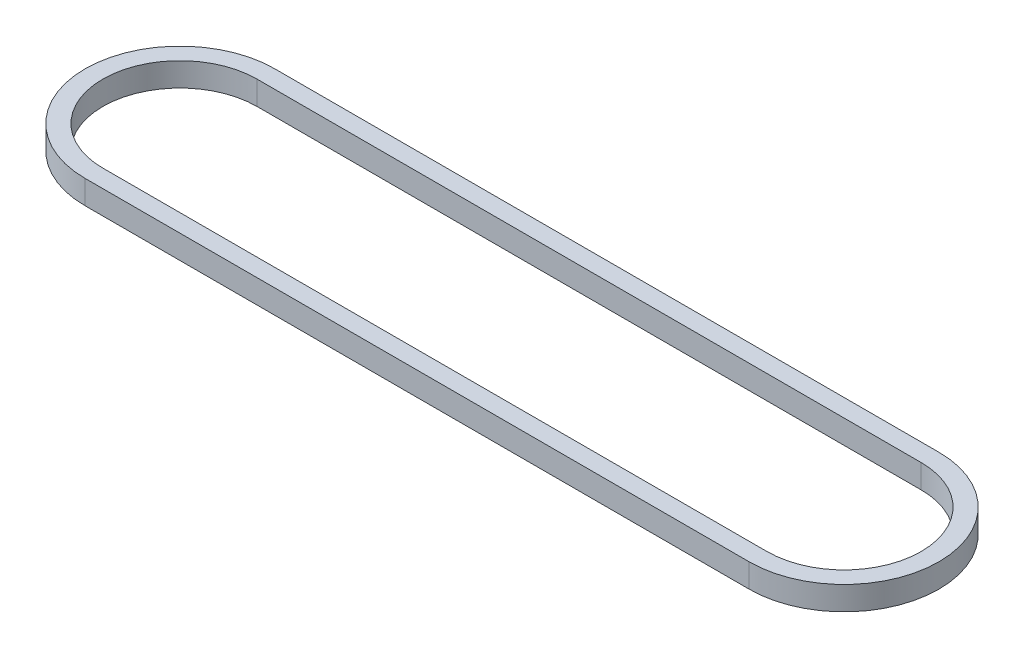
ISO-10303-21;
HEADER;
FILE_DESCRIPTION(('STEP AP214'),'2;1');
FILE_NAME('part.step','',(''),(''),'','','');
FILE_SCHEMA(('AUTOMOTIVE_DESIGN { 1 0 10303 214 1 1 1 1 }'));
ENDSEC;
DATA;
#1=APPLICATION_CONTEXT('core data for automotive mechanical design processes');
#2=APPLICATION_PROTOCOL_DEFINITION('international standard','automotive_design',2000,#1);
#3=PRODUCT_CONTEXT('',#1,'mechanical');
#4=PRODUCT('Part','Part','',(#3));
#5=PRODUCT_RELATED_PRODUCT_CATEGORY('part','',(#4));
#6=PRODUCT_DEFINITION_FORMATION('','',#4);
#7=PRODUCT_DEFINITION_CONTEXT('part definition',#1,'design');
#8=PRODUCT_DEFINITION('design','',#6,#7);
#9=PRODUCT_DEFINITION_SHAPE('','',#8);
#10=(LENGTH_UNIT() NAMED_UNIT(*) SI_UNIT(.MILLI.,.METRE.));
#11=(NAMED_UNIT(*) PLANE_ANGLE_UNIT() SI_UNIT($,.RADIAN.));
#12=(NAMED_UNIT(*) SI_UNIT($,.STERADIAN.) SOLID_ANGLE_UNIT());
#13=UNCERTAINTY_MEASURE_WITH_UNIT(LENGTH_MEASURE(1.E-05),#10,'distance_accuracy_value','');
#14=(GEOMETRIC_REPRESENTATION_CONTEXT(3) GLOBAL_UNCERTAINTY_ASSIGNED_CONTEXT((#13)) GLOBAL_UNIT_ASSIGNED_CONTEXT((#10,
#11,#12)) REPRESENTATION_CONTEXT('',''));
#15=CARTESIAN_POINT('',(0.,0.,0.));
#16=DIRECTION('',(0.,0.,1.));
#17=DIRECTION('',(1.,0.,0.));
#18=AXIS2_PLACEMENT_3D('',#15,#16,#17);
#19=CARTESIAN_POINT('',(280.,10.,0.));
#20=DIRECTION('',(0.,-1.,0.));
#21=DIRECTION('',(0.,0.,-1.));
#22=AXIS2_PLACEMENT_3D('',#19,#20,#21);
#23=CYLINDRICAL_SURFACE('',#22,32.5);
#24=CARTESIAN_POINT('',(280.,0.,0.));
#25=DIRECTION('',(0.,1.,0.));
#26=DIRECTION('',(0.,0.,1.));
#27=AXIS2_PLACEMENT_3D('',#24,#25,#26);
#28=CIRCLE('',#27,32.5);
#29=CARTESIAN_POINT('',(280.,0.,32.5));
#30=VERTEX_POINT('',#29);
#31=CARTESIAN_POINT('',(280.,0.,-32.5));
#32=VERTEX_POINT('',#31);
#33=EDGE_CURVE('E142',#30,#32,#28,.T.);
#34=ORIENTED_EDGE('',*,*,#33,.F.);
#35=DIRECTION('',(0.,-1.,0.));
#36=VECTOR('',#35,1.);
#37=CARTESIAN_POINT('',(280.,10.,32.5));
#38=LINE('',#37,#36);
#39=CARTESIAN_POINT('',(280.,10.,32.5));
#40=VERTEX_POINT('',#39);
#41=EDGE_CURVE('E11',#40,#30,#38,.T.);
#42=ORIENTED_EDGE('',*,*,#41,.F.);
#43=CARTESIAN_POINT('',(280.,10.,0.));
#44=DIRECTION('',(0.,1.,0.));
#45=DIRECTION('',(0.,0.,1.));
#46=AXIS2_PLACEMENT_3D('',#43,#44,#45);
#47=CIRCLE('',#46,32.5);
#48=CARTESIAN_POINT('',(280.,10.,-32.5));
#49=VERTEX_POINT('',#48);
#50=EDGE_CURVE('E114',#40,#49,#47,.T.);
#51=ORIENTED_EDGE('',*,*,#50,.T.);
#52=DIRECTION('',(0.,-1.,0.));
#53=VECTOR('',#52,1.);
#54=CARTESIAN_POINT('',(280.,10.,-32.5));
#55=LINE('',#54,#53);
#56=EDGE_CURVE('E87',#49,#32,#55,.T.);
#57=ORIENTED_EDGE('',*,*,#56,.T.);
#58=EDGE_LOOP('',(#34,#42,#51,#57));
#59=FACE_BOUND('',#58,.T.);
#60=ADVANCED_FACE('F34',(#59),#23,.F.);
#61=CARTESIAN_POINT('',(-146.986327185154,10.,32.5));
#62=DIRECTION('',(0.,0.,1.));
#63=DIRECTION('',(1.,0.,0.));
#64=AXIS2_PLACEMENT_3D('',#61,#62,#63);
#65=PLANE('',#64);
#66=DIRECTION('',(-1.,0.,0.));
#67=VECTOR('',#66,1.);
#68=CARTESIAN_POINT('',(-146.986327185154,0.,32.5));
#69=LINE('',#68,#67);
#70=CARTESIAN_POINT('',(0.,0.,32.5));
#71=VERTEX_POINT('',#70);
#72=EDGE_CURVE('E120',#30,#71,#69,.T.);
#73=ORIENTED_EDGE('',*,*,#72,.T.);
#74=DIRECTION('',(0.,-1.,0.));
#75=VECTOR('',#74,1.);
#76=CARTESIAN_POINT('',(0.,10.,32.5));
#77=LINE('',#76,#75);
#78=CARTESIAN_POINT('',(0.,10.,32.5));
#79=VERTEX_POINT('',#78);
#80=EDGE_CURVE('E44',#79,#71,#77,.T.);
#81=ORIENTED_EDGE('',*,*,#80,.F.);
#82=DIRECTION('',(-1.,0.,0.));
#83=VECTOR('',#82,1.);
#84=CARTESIAN_POINT('',(-146.986327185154,10.,32.5));
#85=LINE('',#84,#83);
#86=EDGE_CURVE('E109',#40,#79,#85,.T.);
#87=ORIENTED_EDGE('',*,*,#86,.F.);
#88=ORIENTED_EDGE('',*,*,#41,.T.);
#89=EDGE_LOOP('',(#73,#81,#87,#88));
#90=FACE_BOUND('',#89,.T.);
#91=ADVANCED_FACE('F118',(#90),#65,.F.);
#92=CARTESIAN_POINT('',(0.,10.,0.));
#93=DIRECTION('',(0.,-1.,0.));
#94=DIRECTION('',(0.,0.,-1.));
#95=AXIS2_PLACEMENT_3D('',#92,#93,#94);
#96=CYLINDRICAL_SURFACE('',#95,32.5);
#97=CARTESIAN_POINT('',(0.,0.,0.));
#98=DIRECTION('',(0.,1.,0.));
#99=DIRECTION('',(0.,0.,1.));
#100=AXIS2_PLACEMENT_3D('',#97,#98,#99);
#101=CIRCLE('',#100,32.5);
#102=CARTESIAN_POINT('',(0.,0.,-32.5));
#103=VERTEX_POINT('',#102);
#104=EDGE_CURVE('E146',#103,#71,#101,.T.);
#105=ORIENTED_EDGE('',*,*,#104,.F.);
#106=DIRECTION('',(0.,-1.,0.));
#107=VECTOR('',#106,1.);
#108=CARTESIAN_POINT('',(0.,10.,-32.5));
#109=LINE('',#108,#107);
#110=CARTESIAN_POINT('',(0.,10.,-32.5));
#111=VERTEX_POINT('',#110);
#112=EDGE_CURVE('E80',#111,#103,#109,.T.);
#113=ORIENTED_EDGE('',*,*,#112,.F.);
#114=CARTESIAN_POINT('',(0.,10.,0.));
#115=DIRECTION('',(0.,1.,0.));
#116=DIRECTION('',(0.,0.,1.));
#117=AXIS2_PLACEMENT_3D('',#114,#115,#116);
#118=CIRCLE('',#117,32.5);
#119=EDGE_CURVE('E113',#111,#79,#118,.T.);
#120=ORIENTED_EDGE('',*,*,#119,.T.);
#121=ORIENTED_EDGE('',*,*,#80,.T.);
#122=EDGE_LOOP('',(#105,#113,#120,#121));
#123=FACE_BOUND('',#122,.T.);
#124=ADVANCED_FACE('F125',(#123),#96,.F.);
#125=CARTESIAN_POINT('',(-146.986327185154,10.,40.));
#126=DIRECTION('',(0.,0.,-1.));
#127=DIRECTION('',(-1.,0.,0.));
#128=AXIS2_PLACEMENT_3D('',#125,#126,#127);
#129=PLANE('',#128);
#130=DIRECTION('',(1.,0.,0.));
#131=VECTOR('',#130,1.);
#132=CARTESIAN_POINT('',(-146.986327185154,0.,40.));
#133=LINE('',#132,#131);
#134=CARTESIAN_POINT('',(0.,0.,40.));
#135=VERTEX_POINT('',#134);
#136=CARTESIAN_POINT('',(280.,0.,40.));
#137=VERTEX_POINT('',#136);
#138=EDGE_CURVE('E131',#135,#137,#133,.T.);
#139=ORIENTED_EDGE('',*,*,#138,.T.);
#140=DIRECTION('',(0.,-1.,0.));
#141=VECTOR('',#140,1.);
#142=CARTESIAN_POINT('',(280.,10.,40.));
#143=LINE('',#142,#141);
#144=CARTESIAN_POINT('',(280.,10.,40.));
#145=VERTEX_POINT('',#144);
#146=EDGE_CURVE('E38',#145,#137,#143,.T.);
#147=ORIENTED_EDGE('',*,*,#146,.F.);
#148=DIRECTION('',(1.,0.,0.));
#149=VECTOR('',#148,1.);
#150=CARTESIAN_POINT('',(-146.986327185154,10.,40.));
#151=LINE('',#150,#149);
#152=CARTESIAN_POINT('',(0.,10.,40.));
#153=VERTEX_POINT('',#152);
#154=EDGE_CURVE('E150',#153,#145,#151,.T.);
#155=ORIENTED_EDGE('',*,*,#154,.F.);
#156=DIRECTION('',(0.,-1.,0.));
#157=VECTOR('',#156,1.);
#158=CARTESIAN_POINT('',(0.,10.,40.));
#159=LINE('',#158,#157);
#160=EDGE_CURVE('E127',#153,#135,#159,.T.);
#161=ORIENTED_EDGE('',*,*,#160,.T.);
#162=EDGE_LOOP('',(#139,#147,#155,#161));
#163=FACE_BOUND('',#162,.T.);
#164=ADVANCED_FACE('F36',(#163),#129,.F.);
#165=CARTESIAN_POINT('',(280.,10.,0.));
#166=DIRECTION('',(0.,-1.,0.));
#167=DIRECTION('',(0.,0.,-1.));
#168=AXIS2_PLACEMENT_3D('',#165,#166,#167);
#169=CYLINDRICAL_SURFACE('',#168,40.);
#170=CARTESIAN_POINT('',(280.,0.,0.));
#171=DIRECTION('',(0.,1.,0.));
#172=DIRECTION('',(0.,0.,1.));
#173=AXIS2_PLACEMENT_3D('',#170,#171,#172);
#174=CIRCLE('',#173,40.);
#175=CARTESIAN_POINT('',(280.,0.,-40.));
#176=VERTEX_POINT('',#175);
#177=EDGE_CURVE('E134',#137,#176,#174,.T.);
#178=ORIENTED_EDGE('',*,*,#177,.T.);
#179=DIRECTION('',(0.,-1.,0.));
#180=VECTOR('',#179,1.);
#181=CARTESIAN_POINT('',(280.,10.,-40.));
#182=LINE('',#181,#180);
#183=CARTESIAN_POINT('',(280.,10.,-40.));
#184=VERTEX_POINT('',#183);
#185=EDGE_CURVE('E156',#184,#176,#182,.T.);
#186=ORIENTED_EDGE('',*,*,#185,.F.);
#187=CARTESIAN_POINT('',(280.,10.,0.));
#188=DIRECTION('',(0.,1.,0.));
#189=DIRECTION('',(0.,0.,1.));
#190=AXIS2_PLACEMENT_3D('',#187,#188,#189);
#191=CIRCLE('',#190,40.);
#192=EDGE_CURVE('E95',#145,#184,#191,.T.);
#193=ORIENTED_EDGE('',*,*,#192,.F.);
#194=ORIENTED_EDGE('',*,*,#146,.T.);
#195=EDGE_LOOP('',(#178,#186,#193,#194));
#196=FACE_BOUND('',#195,.T.);
#197=ADVANCED_FACE('F161',(#196),#169,.T.);
#198=CARTESIAN_POINT('',(-146.986327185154,10.,-40.));
#199=DIRECTION('',(0.,0.,-1.));
#200=DIRECTION('',(-1.,0.,0.));
#201=AXIS2_PLACEMENT_3D('',#198,#199,#200);
#202=PLANE('',#201);
#203=DIRECTION('',(1.,0.,0.));
#204=VECTOR('',#203,1.);
#205=CARTESIAN_POINT('',(-146.986327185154,0.,-40.));
#206=LINE('',#205,#204);
#207=CARTESIAN_POINT('',(0.,0.,-40.));
#208=VERTEX_POINT('',#207);
#209=EDGE_CURVE('E137',#208,#176,#206,.T.);
#210=ORIENTED_EDGE('',*,*,#209,.F.);
#211=DIRECTION('',(0.,-1.,0.));
#212=VECTOR('',#211,1.);
#213=CARTESIAN_POINT('',(0.,10.,-40.));
#214=LINE('',#213,#212);
#215=CARTESIAN_POINT('',(0.,10.,-40.));
#216=VERTEX_POINT('',#215);
#217=EDGE_CURVE('E155',#216,#208,#214,.T.);
#218=ORIENTED_EDGE('',*,*,#217,.F.);
#219=DIRECTION('',(1.,0.,0.));
#220=VECTOR('',#219,1.);
#221=CARTESIAN_POINT('',(-146.986327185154,10.,-40.));
#222=LINE('',#221,#220);
#223=EDGE_CURVE('E173',#216,#184,#222,.T.);
#224=ORIENTED_EDGE('',*,*,#223,.T.);
#225=ORIENTED_EDGE('',*,*,#185,.T.);
#226=EDGE_LOOP('',(#210,#218,#224,#225));
#227=FACE_BOUND('',#226,.T.);
#228=ADVANCED_FACE('F170',(#227),#202,.T.);
#229=CARTESIAN_POINT('',(0.,10.,0.));
#230=DIRECTION('',(0.,-1.,0.));
#231=DIRECTION('',(0.,0.,-1.));
#232=AXIS2_PLACEMENT_3D('',#229,#230,#231);
#233=CYLINDRICAL_SURFACE('',#232,40.);
#234=CARTESIAN_POINT('',(0.,0.,0.));
#235=DIRECTION('',(0.,1.,0.));
#236=DIRECTION('',(0.,0.,1.));
#237=AXIS2_PLACEMENT_3D('',#234,#235,#236);
#238=CIRCLE('',#237,40.);
#239=EDGE_CURVE('E140',#208,#135,#238,.T.);
#240=ORIENTED_EDGE('',*,*,#239,.T.);
#241=ORIENTED_EDGE('',*,*,#160,.F.);
#242=CARTESIAN_POINT('',(0.,10.,0.));
#243=DIRECTION('',(0.,1.,0.));
#244=DIRECTION('',(0.,0.,1.));
#245=AXIS2_PLACEMENT_3D('',#242,#243,#244);
#246=CIRCLE('',#245,40.);
#247=EDGE_CURVE('E175',#216,#153,#246,.T.);
#248=ORIENTED_EDGE('',*,*,#247,.F.);
#249=ORIENTED_EDGE('',*,*,#217,.T.);
#250=EDGE_LOOP('',(#240,#241,#248,#249));
#251=FACE_BOUND('',#250,.T.);
#252=ADVANCED_FACE('F176',(#251),#233,.T.);
#253=CARTESIAN_POINT('',(-146.986327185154,10.,-32.5));
#254=DIRECTION('',(0.,0.,-1.));
#255=DIRECTION('',(-1.,0.,0.));
#256=AXIS2_PLACEMENT_3D('',#253,#254,#255);
#257=PLANE('',#256);
#258=DIRECTION('',(1.,0.,0.));
#259=VECTOR('',#258,1.);
#260=CARTESIAN_POINT('',(-146.986327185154,0.,-32.5));
#261=LINE('',#260,#259);
#262=EDGE_CURVE('E148',#103,#32,#261,.T.);
#263=ORIENTED_EDGE('',*,*,#262,.T.);
#264=ORIENTED_EDGE('',*,*,#56,.F.);
#265=DIRECTION('',(1.,0.,0.));
#266=VECTOR('',#265,1.);
#267=CARTESIAN_POINT('',(-146.986327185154,10.,-32.5));
#268=LINE('',#267,#266);
#269=EDGE_CURVE('E53',#111,#49,#268,.T.);
#270=ORIENTED_EDGE('',*,*,#269,.F.);
#271=ORIENTED_EDGE('',*,*,#112,.T.);
#272=EDGE_LOOP('',(#263,#264,#270,#271));
#273=FACE_BOUND('',#272,.T.);
#274=ADVANCED_FACE('F182',(#273),#257,.F.);
#275=CARTESIAN_POINT('',(-146.986327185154,10.,0.));
#276=DIRECTION('',(0.,1.,0.));
#277=DIRECTION('',(0.,0.,1.));
#278=AXIS2_PLACEMENT_3D('',#275,#276,#277);
#279=PLANE('',#278);
#280=ORIENTED_EDGE('',*,*,#154,.T.);
#281=ORIENTED_EDGE('',*,*,#192,.T.);
#282=ORIENTED_EDGE('',*,*,#223,.F.);
#283=ORIENTED_EDGE('',*,*,#247,.T.);
#284=EDGE_LOOP('',(#280,#281,#282,#283));
#285=FACE_BOUND('',#284,.T.);
#286=ORIENTED_EDGE('',*,*,#50,.F.);
#287=ORIENTED_EDGE('',*,*,#86,.T.);
#288=ORIENTED_EDGE('',*,*,#119,.F.);
#289=ORIENTED_EDGE('',*,*,#269,.T.);
#290=EDGE_LOOP('',(#286,#287,#288,#289));
#291=FACE_BOUND('',#290,.T.);
#292=ADVANCED_FACE('F111',(#285,#291),#279,.T.);
#293=CARTESIAN_POINT('',(-146.986327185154,0.,0.));
#294=DIRECTION('',(0.,1.,0.));
#295=DIRECTION('',(0.,0.,1.));
#296=AXIS2_PLACEMENT_3D('',#293,#294,#295);
#297=PLANE('',#296);
#298=ORIENTED_EDGE('',*,*,#138,.F.);
#299=ORIENTED_EDGE('',*,*,#239,.F.);
#300=ORIENTED_EDGE('',*,*,#209,.T.);
#301=ORIENTED_EDGE('',*,*,#177,.F.);
#302=EDGE_LOOP('',(#298,#299,#300,#301));
#303=FACE_BOUND('',#302,.T.);
#304=ORIENTED_EDGE('',*,*,#33,.T.);
#305=ORIENTED_EDGE('',*,*,#262,.F.);
#306=ORIENTED_EDGE('',*,*,#104,.T.);
#307=ORIENTED_EDGE('',*,*,#72,.F.);
#308=EDGE_LOOP('',(#304,#305,#306,#307));
#309=FACE_BOUND('',#308,.T.);
#310=ADVANCED_FACE('F168',(#303,#309),#297,.F.);
#311=CLOSED_SHELL('',(#60,#91,#124,#164,#197,#228,#252,#274,#292,#310));
#312=MANIFOLD_SOLID_BREP('B2',#311);
#313=ADVANCED_BREP_SHAPE_REPRESENTATION('',(#18,#312),#14);
#314=SHAPE_DEFINITION_REPRESENTATION(#9,#313);
ENDSEC;
END-ISO-10303-21;
